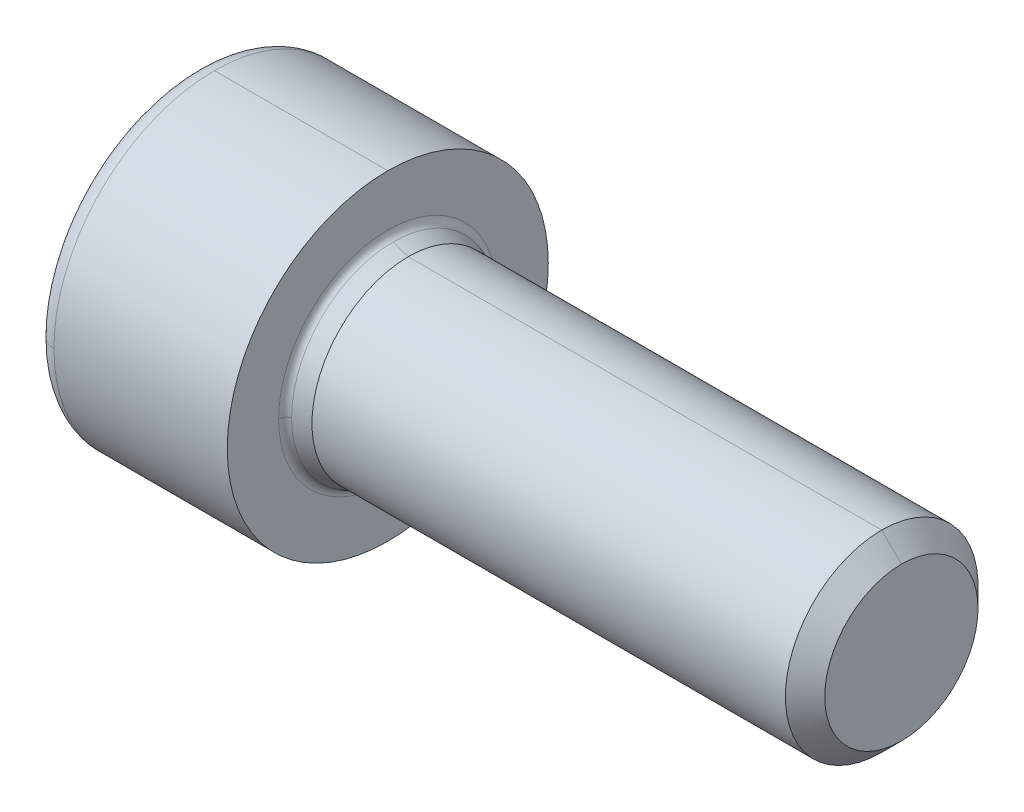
ISO-10303-21;
HEADER;
FILE_DESCRIPTION(('STEP AP214'),'2;1');
FILE_NAME('part.step','',(''),(''),'','','');
FILE_SCHEMA(('AUTOMOTIVE_DESIGN { 1 0 10303 214 1 1 1 1 }'));
ENDSEC;
DATA;
#1=APPLICATION_CONTEXT('core data for automotive mechanical design processes');
#2=APPLICATION_PROTOCOL_DEFINITION('international standard','automotive_design',2000,#1);
#3=PRODUCT_CONTEXT('',#1,'mechanical');
#4=PRODUCT('Part','Part','',(#3));
#5=PRODUCT_RELATED_PRODUCT_CATEGORY('part','',(#4));
#6=PRODUCT_DEFINITION_FORMATION('','',#4);
#7=PRODUCT_DEFINITION_CONTEXT('part definition',#1,'design');
#8=PRODUCT_DEFINITION('design','',#6,#7);
#9=PRODUCT_DEFINITION_SHAPE('','',#8);
#10=(LENGTH_UNIT() NAMED_UNIT(*) SI_UNIT(.MILLI.,.METRE.));
#11=(NAMED_UNIT(*) PLANE_ANGLE_UNIT() SI_UNIT($,.RADIAN.));
#12=(NAMED_UNIT(*) SI_UNIT($,.STERADIAN.) SOLID_ANGLE_UNIT());
#13=UNCERTAINTY_MEASURE_WITH_UNIT(LENGTH_MEASURE(1.E-05),#10,'distance_accuracy_value','');
#14=(GEOMETRIC_REPRESENTATION_CONTEXT(3) GLOBAL_UNCERTAINTY_ASSIGNED_CONTEXT((#13)) GLOBAL_UNIT_ASSIGNED_CONTEXT((#10,
#11,#12)) REPRESENTATION_CONTEXT('',''));
#15=CARTESIAN_POINT('',(0.,0.,0.));
#16=DIRECTION('',(0.,0.,1.));
#17=DIRECTION('',(1.,0.,0.));
#18=AXIS2_PLACEMENT_3D('',#15,#16,#17);
#19=CARTESIAN_POINT('',(-1.626424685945,0.,0.));
#20=DIRECTION('',(-1.,0.,0.));
#21=DIRECTION('',(0.,-1.,0.));
#22=AXIS2_PLACEMENT_3D('',#19,#20,#21);
#23=CONICAL_SURFACE('',#22,1.214285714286,1.0471975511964);
#24=DIRECTION('',(0.500000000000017,-0.866025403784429,0.));
#25=VECTOR('',#24,1.);
#26=CARTESIAN_POINT('',(-2.3,2.380952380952,0.));
#27=LINE('',#26,#25);
#28=CARTESIAN_POINT('',(-2.3,2.380952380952,0.));
#29=VERTEX_POINT('',#28);
#30=CARTESIAN_POINT('',(-0.9253565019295,0.,0.));
#31=VERTEX_POINT('',#30);
#32=EDGE_CURVE('E28',#29,#31,#27,.T.);
#33=ORIENTED_EDGE('',*,*,#32,.F.);
#34=CARTESIAN_POINT('',(-2.3,0.,0.));
#35=DIRECTION('',(1.,0.,0.));
#36=DIRECTION('',(0.,-1.,0.));
#37=AXIS2_PLACEMENT_3D('',#34,#35,#36);
#38=CIRCLE('',#37,2.380952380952);
#39=CARTESIAN_POINT('',(-2.3,-2.380952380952,0.));
#40=VERTEX_POINT('',#39);
#41=EDGE_CURVE('E477',#40,#29,#38,.T.);
#42=ORIENTED_EDGE('',*,*,#41,.F.);
#43=DIRECTION('',(-0.500000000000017,-0.866025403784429,0.));
#44=VECTOR('',#43,1.);
#45=CARTESIAN_POINT('',(-0.9253565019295,0.,0.));
#46=LINE('',#45,#44);
#47=EDGE_CURVE('E11',#31,#40,#46,.T.);
#48=ORIENTED_EDGE('',*,*,#47,.F.);
#49=EDGE_LOOP('',(#33,#42,#48));
#50=FACE_BOUND('',#49,.T.);
#51=ADVANCED_FACE('F16',(#50),#23,.F.);
#52=CARTESIAN_POINT('',(-1.626424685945,0.,0.));
#53=DIRECTION('',(-1.,0.,0.));
#54=DIRECTION('',(0.,-1.,0.));
#55=AXIS2_PLACEMENT_3D('',#52,#53,#54);
#56=CONICAL_SURFACE('',#55,1.214285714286,1.0471975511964);
#57=CARTESIAN_POINT('',(-2.3,0.,0.));
#58=DIRECTION('',(1.,0.,0.));
#59=DIRECTION('',(0.,1.,0.));
#60=AXIS2_PLACEMENT_3D('',#57,#58,#59);
#61=CIRCLE('',#60,2.380952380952);
#62=EDGE_CURVE('E484',#29,#40,#61,.T.);
#63=ORIENTED_EDGE('',*,*,#62,.F.);
#64=ORIENTED_EDGE('',*,*,#32,.T.);
#65=ORIENTED_EDGE('',*,*,#47,.T.);
#66=EDGE_LOOP('',(#63,#64,#65));
#67=FACE_BOUND('',#66,.T.);
#68=ADVANCED_FACE('F471',(#67),#56,.F.);
#69=CARTESIAN_POINT('',(-2.3,0.,0.));
#70=DIRECTION('',(1.,0.,0.));
#71=DIRECTION('',(0.,1.,0.));
#72=AXIS2_PLACEMENT_3D('',#69,#70,#71);
#73=PLANE('',#72);
#74=ORIENTED_EDGE('',*,*,#62,.T.);
#75=ORIENTED_EDGE('',*,*,#41,.T.);
#76=EDGE_LOOP('',(#74,#75));
#77=FACE_BOUND('',#76,.T.);
#78=DIRECTION('',(0.,0.500000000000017,-0.866025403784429));
#79=VECTOR('',#78,1.);
#80=CARTESIAN_POINT('',(-2.3,1.443375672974,2.5));
#81=LINE('',#80,#79);
#82=CARTESIAN_POINT('',(-2.3,1.443375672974,2.5));
#83=VERTEX_POINT('',#82);
#84=CARTESIAN_POINT('',(-2.3,2.886751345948,0.));
#85=VERTEX_POINT('',#84);
#86=EDGE_CURVE('E147',#83,#85,#81,.T.);
#87=ORIENTED_EDGE('',*,*,#86,.T.);
#88=DIRECTION('',(0.,-0.500000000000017,-0.866025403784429));
#89=VECTOR('',#88,1.);
#90=CARTESIAN_POINT('',(-2.3,2.886751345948,0.));
#91=LINE('',#90,#89);
#92=CARTESIAN_POINT('',(-2.3,1.443375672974,-2.5));
#93=VERTEX_POINT('',#92);
#94=EDGE_CURVE('E104',#85,#93,#91,.T.);
#95=ORIENTED_EDGE('',*,*,#94,.T.);
#96=DIRECTION('',(0.,-1.,0.));
#97=VECTOR('',#96,1.);
#98=CARTESIAN_POINT('',(-2.3,1.443375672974,-2.5));
#99=LINE('',#98,#97);
#100=CARTESIAN_POINT('',(-2.3,-1.443375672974,-2.5));
#101=VERTEX_POINT('',#100);
#102=EDGE_CURVE('E378',#93,#101,#99,.T.);
#103=ORIENTED_EDGE('',*,*,#102,.T.);
#104=DIRECTION('',(0.,-0.500000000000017,0.866025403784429));
#105=VECTOR('',#104,1.);
#106=CARTESIAN_POINT('',(-2.3,-1.443375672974,-2.5));
#107=LINE('',#106,#105);
#108=CARTESIAN_POINT('',(-2.3,-2.886751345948,0.));
#109=VERTEX_POINT('',#108);
#110=EDGE_CURVE('E390',#101,#109,#107,.T.);
#111=ORIENTED_EDGE('',*,*,#110,.T.);
#112=DIRECTION('',(0.,0.500000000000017,0.866025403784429));
#113=VECTOR('',#112,1.);
#114=CARTESIAN_POINT('',(-2.3,-2.886751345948,0.));
#115=LINE('',#114,#113);
#116=CARTESIAN_POINT('',(-2.3,-1.443375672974,2.5));
#117=VERTEX_POINT('',#116);
#118=EDGE_CURVE('E445',#109,#117,#115,.T.);
#119=ORIENTED_EDGE('',*,*,#118,.T.);
#120=DIRECTION('',(0.,1.,0.));
#121=VECTOR('',#120,1.);
#122=CARTESIAN_POINT('',(-2.3,-1.443375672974,2.5));
#123=LINE('',#122,#121);
#124=EDGE_CURVE('E304',#117,#83,#123,.T.);
#125=ORIENTED_EDGE('',*,*,#124,.T.);
#126=EDGE_LOOP('',(#87,#95,#103,#111,#119,#125));
#127=FACE_BOUND('',#126,.T.);
#128=ADVANCED_FACE('F276',(#77,#127),#73,.F.);
#129=CARTESIAN_POINT('',(-4.15,0.,2.5));
#130=DIRECTION('',(0.,0.,1.));
#131=DIRECTION('',(1.,0.,0.));
#132=AXIS2_PLACEMENT_3D('',#129,#130,#131);
#133=PLANE('',#132);
#134=CARTESIAN_POINT('',(-6.01416810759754,1.43789133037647,2.5));
#135=DIRECTION('',(0.99999890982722,0.00147659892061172,0.));
#136=VECTOR('',#135,1.);
#137=LINE('',#134,#136);
#138=CARTESIAN_POINT('',(-6.01165739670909,1.43937517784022,2.49307093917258));
#139=VERTEX_POINT('',#138);
#140=EDGE_CURVE('E135',#139,#83,#137,.T.);
#141=ORIENTED_EDGE('',*,*,#140,.T.);
#142=ORIENTED_EDGE('',*,*,#124,.F.);
#143=CARTESIAN_POINT('',(-2.3,-1.443375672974,2.5));
#144=DIRECTION('',(-0.999998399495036,0.0017891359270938,0.));
#145=VECTOR('',#144,1.);
#146=LINE('',#143,#145);
#147=CARTESIAN_POINT('',(-6.00854964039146,-1.43771339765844,2.49162942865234));
#148=VERTEX_POINT('',#147);
#149=EDGE_CURVE('E299',#117,#148,#146,.T.);
#150=ORIENTED_EDGE('',*,*,#149,.T.);
#151=CARTESIAN_POINT('',(-6.01497538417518,1.43748769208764,2.48980171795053));
#152=CARTESIAN_POINT('',(-5.97497860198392,1.35142540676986,2.49327300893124));
#153=CARTESIAN_POINT('',(-5.93663935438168,1.26451773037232,2.49571724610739));
#154=CARTESIAN_POINT('',(-5.88367626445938,1.13499719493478,2.49819799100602));
#155=CARTESIAN_POINT('',(-5.86719191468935,1.093148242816,2.49882464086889));
#156=CARTESIAN_POINT('',(-5.83598603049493,1.01038264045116,2.49977703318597));
#157=CARTESIAN_POINT('',(-5.82122403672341,0.969481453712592,2.50011211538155));
#158=CARTESIAN_POINT('',(-5.79346687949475,0.888501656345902,2.50057057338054));
#159=CARTESIAN_POINT('',(-5.78043102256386,0.848437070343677,2.50070021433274));
#160=CARTESIAN_POINT('',(-5.75612515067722,0.769011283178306,2.5008240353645));
#161=CARTESIAN_POINT('',(-5.74481562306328,0.729662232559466,2.50082194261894));
#162=CARTESIAN_POINT('',(-5.72396098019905,0.651540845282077,2.50074597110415));
#163=CARTESIAN_POINT('',(-5.71437909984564,0.612778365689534,2.500673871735));
#164=CARTESIAN_POINT('',(-5.69697650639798,0.53569644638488,2.5005076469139));
#165=CARTESIAN_POINT('',(-5.68912360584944,0.497384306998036,2.50041400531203));
#166=CARTESIAN_POINT('',(-5.6751733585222,0.421063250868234,2.50023895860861));
#167=CARTESIAN_POINT('',(-5.6690503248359,0.383059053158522,2.50015738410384));
#168=CARTESIAN_POINT('',(-5.65855414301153,0.307208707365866,2.50002675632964));
#169=CARTESIAN_POINT('',(-5.65416358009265,0.269364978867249,2.49997737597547));
#170=CARTESIAN_POINT('',(-5.64711793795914,0.19368581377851,2.49990783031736));
#171=CARTESIAN_POINT('',(-5.64445519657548,0.155851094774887,2.4998875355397));
#172=CARTESIAN_POINT('',(-5.64087538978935,0.0800367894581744,2.49988157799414));
#173=CARTESIAN_POINT('',(-5.63996123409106,0.0420570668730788,2.4998959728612));
#174=CARTESIAN_POINT('',(-5.63978845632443,-0.0355830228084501,2.49984980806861));
#175=CARTESIAN_POINT('',(-5.64060474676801,-0.0752435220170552,2.49978590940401));
#176=CARTESIAN_POINT('',(-5.64401296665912,-0.154106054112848,2.49957378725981));
#177=CARTESIAN_POINT('',(-5.64658773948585,-0.193308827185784,2.4994263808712));
#178=CARTESIAN_POINT('',(-5.65352363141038,-0.271415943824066,2.49912831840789));
#179=CARTESIAN_POINT('',(-5.65787837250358,-0.310320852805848,2.49897767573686));
#180=CARTESIAN_POINT('',(-5.66835679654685,-0.387990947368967,2.49870679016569));
#181=CARTESIAN_POINT('',(-5.67448490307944,-0.426755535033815,2.49858662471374));
#182=CARTESIAN_POINT('',(-5.68850264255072,-0.504299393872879,2.49840239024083));
#183=CARTESIAN_POINT('',(-5.69640660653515,-0.543076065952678,2.49833879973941));
#184=CARTESIAN_POINT('',(-5.7139590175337,-0.620796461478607,2.498265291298));
#185=CARTESIAN_POINT('',(-5.72363011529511,-0.659735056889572,2.4982561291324));
#186=CARTESIAN_POINT('',(-5.74418074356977,-0.735858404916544,2.4983128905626));
#187=CARTESIAN_POINT('',(-5.75500744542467,-0.773057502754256,2.4983762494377));
#188=CARTESIAN_POINT('',(-5.77844915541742,-0.848801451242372,2.49846100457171));
#189=CARTESIAN_POINT('',(-5.79112421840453,-0.887327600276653,2.49848029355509));
#190=CARTESIAN_POINT('',(-5.81825902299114,-0.965865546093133,2.49831907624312));
#191=CARTESIAN_POINT('',(-5.83277580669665,-1.00585752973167,2.49812872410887));
#192=CARTESIAN_POINT('',(-5.86359417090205,-1.08745453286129,2.49738046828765));
#193=CARTESIAN_POINT('',(-5.87994883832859,-1.12903920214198,2.49680451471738));
#194=CARTESIAN_POINT('',(-5.93306399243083,-1.25967471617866,2.49420353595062));
#195=CARTESIAN_POINT('',(-5.97155353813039,-1.34801212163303,2.49127301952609));
#196=CARTESIAN_POINT('',(-6.01131599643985,-1.43565799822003,2.48663259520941));
#197=B_SPLINE_CURVE_WITH_KNOTS('',3,(#151,#152,#153,#154,#155,#156,#157,#158,#159,#160,#161,
#162,#163,#164,#165,#166,#167,#168,#169,#170,#171,#172,#173,#174,#175,#176,#177,#178,#179,#180,
#181,#182,#183,#184,#185,#186,#187,#188,#189,#190,#191,#192,#193,#194,#195,#196),.UNSPECIFIED.,
.F.,.F.,(4,2,2,2,2,2,2,2,2,2,2,2,2,2,2,2,2,2,2,2,2,2,4),(0.,0.28489671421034,0.419830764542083,
0.5502640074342,0.676637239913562,0.799436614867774,0.919194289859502,1.03648727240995,
1.15193406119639,1.26618886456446,1.37993346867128,1.4938671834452,1.61283361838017,
1.73065563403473,1.84805911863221,1.96575802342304,2.08444323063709,2.20477268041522,
2.3209747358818,2.44262633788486,2.57024463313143,2.70429811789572,2.99335390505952),.UNSPECIFIED.);
#198=EDGE_CURVE('E80',#139,#148,#197,.T.);
#199=ORIENTED_EDGE('',*,*,#198,.F.);
#200=EDGE_LOOP('',(#141,#142,#150,#199));
#201=FACE_BOUND('',#200,.T.);
#202=ADVANCED_FACE('F267',(#201),#133,.F.);
#203=CARTESIAN_POINT('',(-5.818898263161,0.,0.));
#204=DIRECTION('',(-1.,0.,0.));
#205=DIRECTION('',(0.,-1.,0.));
#206=AXIS2_PLACEMENT_3D('',#203,#204,#205);
#207=CONICAL_SURFACE('',#206,2.678898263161,0.785398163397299);
#208=CARTESIAN_POINT('',(-6.,1.43789133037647,2.49050083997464));
#209=CARTESIAN_POINT('',(-6.,-0.00524433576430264,3.2514933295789));
#210=CARTESIAN_POINT('',(-6.,-1.43673948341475,2.48850578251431));
#211=B_SPLINE_CURVE_WITH_KNOTS('',2,(#208,#209,#210),.UNSPECIFIED.,.F.,.F.,(3,3),(0.,1.),.UNSPECIFIED.);
#212=EDGE_CURVE('E342',#139,#148,#211,.T.);
#213=ORIENTED_EDGE('',*,*,#212,.F.);
#214=ORIENTED_EDGE('',*,*,#198,.T.);
#215=EDGE_LOOP('',(#213,#214));
#216=FACE_BOUND('',#215,.T.);
#217=ADVANCED_FACE('F166',(#216),#207,.F.);
#218=CARTESIAN_POINT('',(-6.,-0.002085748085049,0.));
#219=DIRECTION('',(1.,0.,0.));
#220=DIRECTION('',(0.,1.,0.));
#221=AXIS2_PLACEMENT_3D('',#218,#219,#220);
#222=PLANE('',#221);
#223=CARTESIAN_POINT('',(-6.,1.43876814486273,-2.49201952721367));
#224=CARTESIAN_POINT('',(-6.,2.80988352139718,-1.6222447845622));
#225=CARTESIAN_POINT('',(-6.,2.87753628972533,0.));
#226=B_SPLINE_CURVE_WITH_KNOTS('',2,(#223,#224,#225),.UNSPECIFIED.,.F.,.F.,(3,3),(0.,1.),.UNSPECIFIED.);
#227=CARTESIAN_POINT('',(-6.0129526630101,1.4399710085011,-2.49410294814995));
#228=VERTEX_POINT('',#227);
#229=CARTESIAN_POINT('',(-6.0129526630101,2.87994201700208,0.));
#230=VERTEX_POINT('',#229);
#231=EDGE_CURVE('E97',#228,#230,#226,.T.);
#232=ORIENTED_EDGE('',*,*,#231,.T.);
#233=CARTESIAN_POINT('',(-6.,2.87753628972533,0.));
#234=CARTESIAN_POINT('',(-6.,2.80965933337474,1.62680484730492));
#235=CARTESIAN_POINT('',(-6.,1.43789133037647,2.49050083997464));
#236=B_SPLINE_CURVE_WITH_KNOTS('',2,(#233,#234,#235),.UNSPECIFIED.,.F.,.F.,(3,3),(0.,1.),.UNSPECIFIED.);
#237=EDGE_CURVE('E114',#230,#139,#236,.T.);
#238=ORIENTED_EDGE('',*,*,#237,.T.);
#239=ORIENTED_EDGE('',*,*,#212,.T.);
#240=CARTESIAN_POINT('',(-6.,-1.43673948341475,2.48850578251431));
#241=CARTESIAN_POINT('',(-6.,-2.10640963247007,2.07097207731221));
#242=CARTESIAN_POINT('',(-6.,-2.4768284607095,1.42999757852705));
#243=CARTESIAN_POINT('',(-6.,-2.8466246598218,0.790100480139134));
#244=CARTESIAN_POINT('',(-6.,-2.87353614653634,0.0016754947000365));
#245=B_SPLINE_CURVE_WITH_KNOTS('',2,(#240,#241,#242,#243,#244),.UNSPECIFIED.,.F.,.F.,(3,2,3),
(0.,0.5,1.),.UNSPECIFIED.);
#246=CARTESIAN_POINT('',(-6.00902250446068,-2.87689843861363,0.00150759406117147));
#247=VERTEX_POINT('',#246);
#248=EDGE_CURVE('E339',#148,#247,#245,.T.);
#249=ORIENTED_EDGE('',*,*,#248,.T.);
#250=CARTESIAN_POINT('',(-6.,-2.87353614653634,0.0016754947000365));
#251=CARTESIAN_POINT('',(-6.,-2.81852743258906,-1.61962534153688));
#252=CARTESIAN_POINT('',(-6.,-1.43820836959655,-2.49104996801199));
#253=B_SPLINE_CURVE_WITH_KNOTS('',2,(#250,#251,#252),.UNSPECIFIED.,.F.,.F.,(3,3),(0.,1.),.UNSPECIFIED.);
#254=CARTESIAN_POINT('',(-6.0126685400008,-1.43968108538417,-2.49360078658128));
#255=VERTEX_POINT('',#254);
#256=EDGE_CURVE('E341',#247,#255,#253,.T.);
#257=ORIENTED_EDGE('',*,*,#256,.T.);
#258=CARTESIAN_POINT('',(-6.,-1.43820836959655,-2.49104996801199));
#259=CARTESIAN_POINT('',(-6.,-0.00251474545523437,-3.24588737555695));
#260=CARTESIAN_POINT('',(-6.,1.43876814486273,-2.49201952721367));
#261=B_SPLINE_CURVE_WITH_KNOTS('',2,(#258,#259,#260),.UNSPECIFIED.,.F.,.F.,(3,3),(0.,1.),.UNSPECIFIED.);
#262=EDGE_CURVE('E117',#255,#228,#261,.T.);
#263=ORIENTED_EDGE('',*,*,#262,.T.);
#264=EDGE_LOOP('',(#232,#238,#239,#249,#257,#263));
#265=FACE_BOUND('',#264,.T.);
#266=CARTESIAN_POINT('',(-6.,0.,0.));
#267=DIRECTION('',(-1.,0.,0.));
#268=DIRECTION('',(0.,0.,-1.));
#269=AXIS2_PLACEMENT_3D('',#266,#267,#268);
#270=CIRCLE('',#269,4.4);
#271=CARTESIAN_POINT('',(-6.,0.,-4.4));
#272=VERTEX_POINT('',#271);
#273=CARTESIAN_POINT('',(-6.,0.,4.4));
#274=VERTEX_POINT('',#273);
#275=EDGE_CURVE('E534',#272,#274,#270,.T.);
#276=ORIENTED_EDGE('',*,*,#275,.T.);
#277=CARTESIAN_POINT('',(-6.,0.,0.));
#278=DIRECTION('',(-1.,0.,0.));
#279=DIRECTION('',(0.,0.,1.));
#280=AXIS2_PLACEMENT_3D('',#277,#278,#279);
#281=CIRCLE('',#280,4.4);
#282=EDGE_CURVE('E495',#274,#272,#281,.T.);
#283=ORIENTED_EDGE('',*,*,#282,.T.);
#284=EDGE_LOOP('',(#276,#283));
#285=FACE_BOUND('',#284,.T.);
#286=ADVANCED_FACE('F110',(#265,#285),#222,.F.);
#287=CARTESIAN_POINT('',(-5.4,0.,0.));
#288=DIRECTION('',(-1.,0.,0.));
#289=DIRECTION('',(0.,0.,1.));
#290=AXIS2_PLACEMENT_3D('',#287,#288,#289);
#291=TOROIDAL_SURFACE('',#290,4.4,0.6);
#292=CARTESIAN_POINT('',(-5.4,0.,0.));
#293=DIRECTION('',(-1.,0.,0.));
#294=DIRECTION('',(0.,0.,1.));
#295=AXIS2_PLACEMENT_3D('',#292,#293,#294);
#296=CIRCLE('',#295,5.);
#297=CARTESIAN_POINT('',(-5.4,0.,5.));
#298=VERTEX_POINT('',#297);
#299=CARTESIAN_POINT('',(-5.4,5.,0.));
#300=VERTEX_POINT('',#299);
#301=EDGE_CURVE('E540',#298,#300,#296,.T.);
#302=ORIENTED_EDGE('',*,*,#301,.T.);
#303=CARTESIAN_POINT('',(-5.4,0.,0.));
#304=DIRECTION('',(-1.,0.,0.));
#305=DIRECTION('',(0.,1.,0.));
#306=AXIS2_PLACEMENT_3D('',#303,#304,#305);
#307=CIRCLE('',#306,5.);
#308=CARTESIAN_POINT('',(-5.4,0.,-5.));
#309=VERTEX_POINT('',#308);
#310=EDGE_CURVE('E548',#300,#309,#307,.T.);
#311=ORIENTED_EDGE('',*,*,#310,.T.);
#312=CARTESIAN_POINT('',(-5.4,0.,-4.4));
#313=DIRECTION('',(0.,-1.,0.));
#314=DIRECTION('',(-1.,0.,0.));
#315=AXIS2_PLACEMENT_3D('',#312,#313,#314);
#316=CIRCLE('',#315,0.6);
#317=EDGE_CURVE('E525',#272,#309,#316,.T.);
#318=ORIENTED_EDGE('',*,*,#317,.F.);
#319=ORIENTED_EDGE('',*,*,#282,.F.);
#320=CARTESIAN_POINT('',(-5.4,0.,4.4));
#321=DIRECTION('',(0.,-1.,0.));
#322=DIRECTION('',(0.,0.,1.));
#323=AXIS2_PLACEMENT_3D('',#320,#321,#322);
#324=CIRCLE('',#323,0.6);
#325=EDGE_CURVE('E516',#298,#274,#324,.T.);
#326=ORIENTED_EDGE('',*,*,#325,.F.);
#327=EDGE_LOOP('',(#302,#311,#318,#319,#326));
#328=FACE_BOUND('',#327,.T.);
#329=ADVANCED_FACE('F165',(#328),#291,.T.);
#330=CARTESIAN_POINT('',(-5.4,0.,0.));
#331=DIRECTION('',(-1.,0.,0.));
#332=DIRECTION('',(0.,0.,1.));
#333=AXIS2_PLACEMENT_3D('',#330,#331,#332);
#334=TOROIDAL_SURFACE('',#333,4.4,0.6);
#335=ORIENTED_EDGE('',*,*,#275,.F.);
#336=ORIENTED_EDGE('',*,*,#317,.T.);
#337=CARTESIAN_POINT('',(-5.4,0.,0.));
#338=DIRECTION('',(-1.,0.,0.));
#339=DIRECTION('',(0.,0.,-1.));
#340=AXIS2_PLACEMENT_3D('',#337,#338,#339);
#341=CIRCLE('',#340,5.);
#342=CARTESIAN_POINT('',(-5.4,-5.,0.));
#343=VERTEX_POINT('',#342);
#344=EDGE_CURVE('E552',#309,#343,#341,.T.);
#345=ORIENTED_EDGE('',*,*,#344,.T.);
#346=CARTESIAN_POINT('',(-5.4,0.,0.));
#347=DIRECTION('',(-1.,0.,0.));
#348=DIRECTION('',(0.,-1.,0.));
#349=AXIS2_PLACEMENT_3D('',#346,#347,#348);
#350=CIRCLE('',#349,5.);
#351=EDGE_CURVE('E539',#343,#298,#350,.T.);
#352=ORIENTED_EDGE('',*,*,#351,.T.);
#353=ORIENTED_EDGE('',*,*,#325,.T.);
#354=EDGE_LOOP('',(#335,#336,#345,#352,#353));
#355=FACE_BOUND('',#354,.T.);
#356=ADVANCED_FACE('F772',(#355),#334,.T.);
#357=CARTESIAN_POINT('',(-5.400000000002,0.,0.));
#358=DIRECTION('',(-1.,0.,0.));
#359=DIRECTION('',(0.,1.,0.));
#360=AXIS2_PLACEMENT_3D('',#357,#358,#359);
#361=CYLINDRICAL_SURFACE('',#360,5.);
#362=ORIENTED_EDGE('',*,*,#301,.F.);
#363=ORIENTED_EDGE('',*,*,#351,.F.);
#364=DIRECTION('',(1.,0.,0.));
#365=VECTOR('',#364,1.);
#366=CARTESIAN_POINT('',(-5.4,-5.,0.));
#367=LINE('',#366,#365);
#368=CARTESIAN_POINT('',(0.,-5.,0.));
#369=VERTEX_POINT('',#368);
#370=EDGE_CURVE('E555',#343,#369,#367,.T.);
#371=ORIENTED_EDGE('',*,*,#370,.T.);
#372=CARTESIAN_POINT('',(0.,0.,0.));
#373=DIRECTION('',(1.,0.,0.));
#374=DIRECTION('',(0.,1.,0.));
#375=AXIS2_PLACEMENT_3D('',#372,#373,#374);
#376=CIRCLE('',#375,5.);
#377=CARTESIAN_POINT('',(0.,5.,0.));
#378=VERTEX_POINT('',#377);
#379=EDGE_CURVE('E562',#378,#369,#376,.T.);
#380=ORIENTED_EDGE('',*,*,#379,.F.);
#381=DIRECTION('',(-1.,0.,0.));
#382=VECTOR('',#381,1.);
#383=CARTESIAN_POINT('',(0.,5.,0.));
#384=LINE('',#383,#382);
#385=EDGE_CURVE('E544',#378,#300,#384,.T.);
#386=ORIENTED_EDGE('',*,*,#385,.T.);
#387=EDGE_LOOP('',(#362,#363,#371,#380,#386));
#388=FACE_BOUND('',#387,.T.);
#389=ADVANCED_FACE('F240',(#388),#361,.T.);
#390=CARTESIAN_POINT('',(-5.400000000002,0.,0.));
#391=DIRECTION('',(-1.,0.,0.));
#392=DIRECTION('',(0.,1.,0.));
#393=AXIS2_PLACEMENT_3D('',#390,#391,#392);
#394=CYLINDRICAL_SURFACE('',#393,5.);
#395=CARTESIAN_POINT('',(0.,0.,0.));
#396=DIRECTION('',(1.,0.,0.));
#397=DIRECTION('',(0.,-1.,0.));
#398=AXIS2_PLACEMENT_3D('',#395,#396,#397);
#399=CIRCLE('',#398,5.);
#400=EDGE_CURVE('E558',#369,#378,#399,.T.);
#401=ORIENTED_EDGE('',*,*,#400,.F.);
#402=ORIENTED_EDGE('',*,*,#370,.F.);
#403=ORIENTED_EDGE('',*,*,#344,.F.);
#404=ORIENTED_EDGE('',*,*,#310,.F.);
#405=ORIENTED_EDGE('',*,*,#385,.F.);
#406=EDGE_LOOP('',(#401,#402,#403,#404,#405));
#407=FACE_BOUND('',#406,.T.);
#408=ADVANCED_FACE('F784',(#407),#394,.T.);
#409=CARTESIAN_POINT('',(0.,0.,0.));
#410=DIRECTION('',(-1.,0.,0.));
#411=DIRECTION('',(0.,0.,1.));
#412=AXIS2_PLACEMENT_3D('',#409,#410,#411);
#413=PLANE('',#412);
#414=CARTESIAN_POINT('',(0.,0.,0.));
#415=DIRECTION('',(-1.,0.,0.));
#416=DIRECTION('',(0.,0.,-1.));
#417=AXIS2_PLACEMENT_3D('',#414,#415,#416);
#418=CIRCLE('',#417,3.4);
#419=CARTESIAN_POINT('',(0.,0.,-3.4));
#420=VERTEX_POINT('',#419);
#421=CARTESIAN_POINT('',(0.,0.,3.4));
#422=VERTEX_POINT('',#421);
#423=EDGE_CURVE('E574',#420,#422,#418,.T.);
#424=ORIENTED_EDGE('',*,*,#423,.T.);
#425=CARTESIAN_POINT('',(0.,0.,0.));
#426=DIRECTION('',(-1.,0.,0.));
#427=DIRECTION('',(0.,0.,1.));
#428=AXIS2_PLACEMENT_3D('',#425,#426,#427);
#429=CIRCLE('',#428,3.4);
#430=EDGE_CURVE('E566',#422,#420,#429,.T.);
#431=ORIENTED_EDGE('',*,*,#430,.T.);
#432=EDGE_LOOP('',(#424,#431));
#433=FACE_BOUND('',#432,.T.);
#434=ORIENTED_EDGE('',*,*,#379,.T.);
#435=ORIENTED_EDGE('',*,*,#400,.T.);
#436=EDGE_LOOP('',(#434,#435));
#437=FACE_BOUND('',#436,.T.);
#438=ADVANCED_FACE('F782',(#433,#437),#413,.F.);
#439=CARTESIAN_POINT('',(0.25,0.,0.));
#440=DIRECTION('',(-1.,0.,0.));
#441=DIRECTION('',(0.,0.,1.));
#442=AXIS2_PLACEMENT_3D('',#439,#440,#441);
#443=TOROIDAL_SURFACE('',#442,3.4,0.25);
#444=CARTESIAN_POINT('',(0.25,0.,-3.4));
#445=DIRECTION('',(0.,-1.,0.));
#446=DIRECTION('',(-0.329372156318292,0.,0.944200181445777));
#447=AXIS2_PLACEMENT_3D('',#444,#445,#446);
#448=CIRCLE('',#447,0.25);
#449=CARTESIAN_POINT('',(0.1676569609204,0.,-3.163949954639));
#450=VERTEX_POINT('',#449);
#451=EDGE_CURVE('E570',#450,#420,#448,.T.);
#452=ORIENTED_EDGE('',*,*,#451,.T.);
#453=ORIENTED_EDGE('',*,*,#430,.F.);
#454=CARTESIAN_POINT('',(0.25,0.,3.4));
#455=DIRECTION('',(0.,-1.,0.));
#456=DIRECTION('',(-1.,0.,0.));
#457=AXIS2_PLACEMENT_3D('',#454,#455,#456);
#458=CIRCLE('',#457,0.25);
#459=CARTESIAN_POINT('',(0.1676569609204,0.,3.163949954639));
#460=VERTEX_POINT('',#459);
#461=EDGE_CURVE('E578',#422,#460,#458,.T.);
#462=ORIENTED_EDGE('',*,*,#461,.T.);
#463=CARTESIAN_POINT('',(0.1676569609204,0.,0.));
#464=DIRECTION('',(-1.,0.,0.));
#465=DIRECTION('',(0.,0.,1.));
#466=AXIS2_PLACEMENT_3D('',#463,#464,#465);
#467=CIRCLE('',#466,3.163949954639);
#468=CARTESIAN_POINT('',(0.1676569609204,3.163949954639,0.));
#469=VERTEX_POINT('',#468);
#470=EDGE_CURVE('E586',#460,#469,#467,.T.);
#471=ORIENTED_EDGE('',*,*,#470,.T.);
#472=CARTESIAN_POINT('',(0.1676569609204,0.,0.));
#473=DIRECTION('',(-1.,0.,0.));
#474=DIRECTION('',(0.,1.,0.));
#475=AXIS2_PLACEMENT_3D('',#472,#473,#474);
#476=CIRCLE('',#475,3.163949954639);
#477=EDGE_CURVE('E591',#469,#450,#476,.T.);
#478=ORIENTED_EDGE('',*,*,#477,.T.);
#479=EDGE_LOOP('',(#452,#453,#462,#471,#478));
#480=FACE_BOUND('',#479,.T.);
#481=ADVANCED_FACE('F668',(#480),#443,.F.);
#482=CARTESIAN_POINT('',(0.25,0.,0.));
#483=DIRECTION('',(-1.,0.,0.));
#484=DIRECTION('',(0.,0.,1.));
#485=AXIS2_PLACEMENT_3D('',#482,#483,#484);
#486=TOROIDAL_SURFACE('',#485,3.4,0.25);
#487=CARTESIAN_POINT('',(0.1676569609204,0.,0.));
#488=DIRECTION('',(-1.,0.,0.));
#489=DIRECTION('',(0.,0.,-1.));
#490=AXIS2_PLACEMENT_3D('',#487,#488,#489);
#491=CIRCLE('',#490,3.163949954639);
#492=CARTESIAN_POINT('',(0.1676569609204,-3.163949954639,0.));
#493=VERTEX_POINT('',#492);
#494=EDGE_CURVE('E595',#450,#493,#491,.T.);
#495=ORIENTED_EDGE('',*,*,#494,.T.);
#496=CARTESIAN_POINT('',(0.1676569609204,0.,0.));
#497=DIRECTION('',(-1.,0.,0.));
#498=DIRECTION('',(0.,-1.,0.));
#499=AXIS2_PLACEMENT_3D('',#496,#497,#498);
#500=CIRCLE('',#499,3.163949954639);
#501=EDGE_CURVE('E582',#493,#460,#500,.T.);
#502=ORIENTED_EDGE('',*,*,#501,.T.);
#503=ORIENTED_EDGE('',*,*,#461,.F.);
#504=ORIENTED_EDGE('',*,*,#423,.F.);
#505=ORIENTED_EDGE('',*,*,#451,.F.);
#506=EDGE_LOOP('',(#495,#502,#503,#504,#505));
#507=FACE_BOUND('',#506,.T.);
#508=ADVANCED_FACE('F777',(#507),#486,.F.);
#509=CARTESIAN_POINT('',(0.4026518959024,0.,0.));
#510=DIRECTION('',(-1.,0.,0.));
#511=DIRECTION('',(0.,-1.,0.));
#512=AXIS2_PLACEMENT_3D('',#509,#510,#511);
#513=CONICAL_SURFACE('',#512,3.081974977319,0.335638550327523);
#514=ORIENTED_EDGE('',*,*,#470,.F.);
#515=ORIENTED_EDGE('',*,*,#501,.F.);
#516=DIRECTION('',(0.944200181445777,0.329372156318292,0.));
#517=VECTOR('',#516,1.);
#518=CARTESIAN_POINT('',(0.1676569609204,-3.163949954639,0.));
#519=LINE('',#518,#517);
#520=CARTESIAN_POINT('',(0.6376468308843,-3.,0.));
#521=VERTEX_POINT('',#520);
#522=EDGE_CURVE('E599',#493,#521,#519,.T.);
#523=ORIENTED_EDGE('',*,*,#522,.T.);
#524=CARTESIAN_POINT('',(0.6376468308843,0.,0.));
#525=DIRECTION('',(1.,0.,0.));
#526=DIRECTION('',(0.,0.,1.));
#527=AXIS2_PLACEMENT_3D('',#524,#525,#526);
#528=CIRCLE('',#527,3.);
#529=CARTESIAN_POINT('',(0.6376468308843,3.,0.));
#530=VERTEX_POINT('',#529);
#531=EDGE_CURVE('E610',#530,#521,#528,.T.);
#532=ORIENTED_EDGE('',*,*,#531,.F.);
#533=DIRECTION('',(-0.944200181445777,0.329372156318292,0.));
#534=VECTOR('',#533,1.);
#535=CARTESIAN_POINT('',(0.6376468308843,3.,0.));
#536=LINE('',#535,#534);
#537=EDGE_CURVE('E590',#530,#469,#536,.T.);
#538=ORIENTED_EDGE('',*,*,#537,.T.);
#539=EDGE_LOOP('',(#514,#515,#523,#532,#538));
#540=FACE_BOUND('',#539,.T.);
#541=ADVANCED_FACE('F656',(#540),#513,.T.);
#542=CARTESIAN_POINT('',(0.4026518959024,0.,0.));
#543=DIRECTION('',(-1.,0.,0.));
#544=DIRECTION('',(0.,-1.,0.));
#545=AXIS2_PLACEMENT_3D('',#542,#543,#544);
#546=CONICAL_SURFACE('',#545,3.081974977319,0.335638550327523);
#547=CARTESIAN_POINT('',(0.6376468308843,0.,0.));
#548=DIRECTION('',(-1.,0.,0.));
#549=DIRECTION('',(0.,1.,0.));
#550=AXIS2_PLACEMENT_3D('',#547,#548,#549);
#551=CIRCLE('',#550,3.);
#552=EDGE_CURVE('E603',#530,#521,#551,.T.);
#553=ORIENTED_EDGE('',*,*,#552,.T.);
#554=ORIENTED_EDGE('',*,*,#522,.F.);
#555=ORIENTED_EDGE('',*,*,#494,.F.);
#556=ORIENTED_EDGE('',*,*,#477,.F.);
#557=ORIENTED_EDGE('',*,*,#537,.F.);
#558=EDGE_LOOP('',(#553,#554,#555,#556,#557));
#559=FACE_BOUND('',#558,.T.);
#560=ADVANCED_FACE('F317',(#559),#546,.T.);
#561=CARTESIAN_POINT('',(0.6799999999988,0.,0.));
#562=DIRECTION('',(-1.,0.,0.));
#563=DIRECTION('',(0.,1.,0.));
#564=AXIS2_PLACEMENT_3D('',#561,#562,#563);
#565=CYLINDRICAL_SURFACE('',#564,3.);
#566=CARTESIAN_POINT('',(15.3865,0.,0.));
#567=DIRECTION('',(1.,0.,0.));
#568=DIRECTION('',(0.,-1.,0.));
#569=AXIS2_PLACEMENT_3D('',#566,#567,#568);
#570=CIRCLE('',#569,3.);
#571=CARTESIAN_POINT('',(15.3865,-3.,0.));
#572=VERTEX_POINT('',#571);
#573=CARTESIAN_POINT('',(15.3865,3.,0.));
#574=VERTEX_POINT('',#573);
#575=EDGE_CURVE('E627',#572,#574,#570,.T.);
#576=ORIENTED_EDGE('',*,*,#575,.F.);
#577=DIRECTION('',(1.,0.,0.));
#578=VECTOR('',#577,1.);
#579=CARTESIAN_POINT('',(0.6376468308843,-3.,0.));
#580=LINE('',#579,#578);
#581=EDGE_CURVE('E607',#521,#572,#580,.T.);
#582=ORIENTED_EDGE('',*,*,#581,.F.);
#583=ORIENTED_EDGE('',*,*,#552,.F.);
#584=DIRECTION('',(-1.,0.,0.));
#585=VECTOR('',#584,1.);
#586=CARTESIAN_POINT('',(15.3865,3.,0.));
#587=LINE('',#586,#585);
#588=EDGE_CURVE('E615',#574,#530,#587,.T.);
#589=ORIENTED_EDGE('',*,*,#588,.F.);
#590=EDGE_LOOP('',(#576,#582,#583,#589));
#591=FACE_BOUND('',#590,.T.);
#592=ADVANCED_FACE('F763',(#591),#565,.T.);
#593=CARTESIAN_POINT('',(0.6799999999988,0.,0.));
#594=DIRECTION('',(-1.,0.,0.));
#595=DIRECTION('',(0.,1.,0.));
#596=AXIS2_PLACEMENT_3D('',#593,#594,#595);
#597=CYLINDRICAL_SURFACE('',#596,3.);
#598=ORIENTED_EDGE('',*,*,#588,.T.);
#599=ORIENTED_EDGE('',*,*,#531,.T.);
#600=ORIENTED_EDGE('',*,*,#581,.T.);
#601=CARTESIAN_POINT('',(15.3865,0.,0.));
#602=DIRECTION('',(1.,0.,0.));
#603=DIRECTION('',(0.,1.,0.));
#604=AXIS2_PLACEMENT_3D('',#601,#602,#603);
#605=CIRCLE('',#604,3.);
#606=EDGE_CURVE('E619',#574,#572,#605,.T.);
#607=ORIENTED_EDGE('',*,*,#606,.F.);
#608=EDGE_LOOP('',(#598,#599,#600,#607));
#609=FACE_BOUND('',#608,.T.);
#610=ADVANCED_FACE('F764',(#609),#597,.T.);
#611=CARTESIAN_POINT('',(15.69325,0.,0.));
#612=DIRECTION('',(-1.,0.,0.));
#613=DIRECTION('',(0.,-1.,0.));
#614=AXIS2_PLACEMENT_3D('',#611,#612,#613);
#615=CONICAL_SURFACE('',#614,2.69325,0.785398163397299);
#616=ORIENTED_EDGE('',*,*,#606,.T.);
#617=DIRECTION('',(0.707106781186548,0.707106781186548,0.));
#618=VECTOR('',#617,1.);
#619=CARTESIAN_POINT('',(15.3865,-3.,0.));
#620=LINE('',#619,#618);
#621=CARTESIAN_POINT('',(16.,-2.3865,0.));
#622=VERTEX_POINT('',#621);
#623=EDGE_CURVE('E631',#572,#622,#620,.T.);
#624=ORIENTED_EDGE('',*,*,#623,.T.);
#625=CARTESIAN_POINT('',(16.,0.,0.));
#626=DIRECTION('',(1.,0.,0.));
#627=DIRECTION('',(0.,1.,0.));
#628=AXIS2_PLACEMENT_3D('',#625,#626,#627);
#629=CIRCLE('',#628,2.3865);
#630=CARTESIAN_POINT('',(16.,2.3865,0.));
#631=VERTEX_POINT('',#630);
#632=EDGE_CURVE('E639',#631,#622,#629,.T.);
#633=ORIENTED_EDGE('',*,*,#632,.F.);
#634=DIRECTION('',(-0.707106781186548,0.707106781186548,0.));
#635=VECTOR('',#634,1.);
#636=CARTESIAN_POINT('',(16.,2.3865,0.));
#637=LINE('',#636,#635);
#638=EDGE_CURVE('E623',#631,#574,#637,.T.);
#639=ORIENTED_EDGE('',*,*,#638,.T.);
#640=EDGE_LOOP('',(#616,#624,#633,#639));
#641=FACE_BOUND('',#640,.T.);
#642=ADVANCED_FACE('F760',(#641),#615,.T.);
#643=CARTESIAN_POINT('',(15.69325,0.,0.));
#644=DIRECTION('',(-1.,0.,0.));
#645=DIRECTION('',(0.,-1.,0.));
#646=AXIS2_PLACEMENT_3D('',#643,#644,#645);
#647=CONICAL_SURFACE('',#646,2.69325,0.785398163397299);
#648=CARTESIAN_POINT('',(16.,0.,0.));
#649=DIRECTION('',(1.,0.,0.));
#650=DIRECTION('',(0.,-1.,0.));
#651=AXIS2_PLACEMENT_3D('',#648,#649,#650);
#652=CIRCLE('',#651,2.3865);
#653=EDGE_CURVE('E635',#622,#631,#652,.T.);
#654=ORIENTED_EDGE('',*,*,#653,.F.);
#655=ORIENTED_EDGE('',*,*,#623,.F.);
#656=ORIENTED_EDGE('',*,*,#575,.T.);
#657=ORIENTED_EDGE('',*,*,#638,.F.);
#658=EDGE_LOOP('',(#654,#655,#656,#657));
#659=FACE_BOUND('',#658,.T.);
#660=ADVANCED_FACE('F241',(#659),#647,.T.);
#661=CARTESIAN_POINT('',(16.,0.,0.));
#662=DIRECTION('',(-1.,0.,0.));
#663=DIRECTION('',(0.,0.,1.));
#664=AXIS2_PLACEMENT_3D('',#661,#662,#663);
#665=PLANE('',#664);
#666=ORIENTED_EDGE('',*,*,#632,.T.);
#667=ORIENTED_EDGE('',*,*,#653,.T.);
#668=EDGE_LOOP('',(#666,#667));
#669=FACE_BOUND('',#668,.T.);
#670=ADVANCED_FACE('F759',(#669),#665,.F.);
#671=CARTESIAN_POINT('',(-5.818898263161,0.,0.));
#672=DIRECTION('',(-1.,0.,0.));
#673=DIRECTION('',(0.,-1.,0.));
#674=AXIS2_PLACEMENT_3D('',#671,#672,#673);
#675=CONICAL_SURFACE('',#674,2.678898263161,0.785398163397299);
#676=ORIENTED_EDGE('',*,*,#262,.F.);
#677=CARTESIAN_POINT('',(-6.01602936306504,-1.43801468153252,-2.49071449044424));
#678=CARTESIAN_POINT('',(-5.98556816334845,-1.37294465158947,-2.49309065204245));
#679=CARTESIAN_POINT('',(-5.95607960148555,-1.30737446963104,-2.49492155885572));
#680=CARTESIAN_POINT('',(-5.90116723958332,-1.17858653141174,-2.49764168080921));
#681=CARTESIAN_POINT('',(-5.87561136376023,-1.11542578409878,-2.49857525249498));
#682=CARTESIAN_POINT('',(-5.82854501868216,-0.991116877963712,-2.49982042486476));
#683=CARTESIAN_POINT('',(-5.80689789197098,-0.930021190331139,-2.50016018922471));
#684=CARTESIAN_POINT('',(-5.76766015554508,-0.809452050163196,-2.50049819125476));
#685=CARTESIAN_POINT('',(-5.7499342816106,-0.750023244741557,-2.50051060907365));
#686=CARTESIAN_POINT('',(-5.72618062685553,-0.661027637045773,-2.50043186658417));
#687=CARTESIAN_POINT('',(-5.71882314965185,-0.631812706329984,-2.50039066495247));
#688=CARTESIAN_POINT('',(-5.70510206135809,-0.573633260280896,-2.50029596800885));
#689=CARTESIAN_POINT('',(-5.69872465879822,-0.544672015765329,-2.50024267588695));
#690=CARTESIAN_POINT('',(-5.68696234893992,-0.486941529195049,-2.50013865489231));
#691=CARTESIAN_POINT('',(-5.68156558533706,-0.458174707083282,-2.50008790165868));
#692=CARTESIAN_POINT('',(-5.67176239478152,-0.400771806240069,-2.49999887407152));
#693=CARTESIAN_POINT('',(-5.66734650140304,-0.372137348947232,-2.49996047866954));
#694=CARTESIAN_POINT('',(-5.65950251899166,-0.314936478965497,-2.49990098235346));
#695=CARTESIAN_POINT('',(-5.65606775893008,-0.286370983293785,-2.49987976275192));
#696=CARTESIAN_POINT('',(-5.65018315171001,-0.229243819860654,-2.49985419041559));
#697=CARTESIAN_POINT('',(-5.64772975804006,-0.200682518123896,-2.49984977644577));
#698=CARTESIAN_POINT('',(-5.64380450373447,-0.143498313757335,-2.49985173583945));
#699=CARTESIAN_POINT('',(-5.64233244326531,-0.114875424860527,-2.49985810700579));
#700=CARTESIAN_POINT('',(-5.64036701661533,-0.0575017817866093,-2.49987068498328));
#701=CARTESIAN_POINT('',(-5.63987689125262,-0.028750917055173,-2.4998768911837));
#702=CARTESIAN_POINT('',(-5.63986975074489,0.0288301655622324,-2.49986975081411));
#703=CARTESIAN_POINT('',(-5.64035542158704,0.0576603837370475,-2.49985635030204));
#704=CARTESIAN_POINT('',(-5.64231375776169,0.115181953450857,-2.49982608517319));
#705=CARTESIAN_POINT('',(-5.64378281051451,0.143873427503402,-2.49980923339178));
#706=CARTESIAN_POINT('',(-5.64770502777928,0.201184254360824,-2.49978530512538));
#707=CARTESIAN_POINT('',(-5.65015803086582,0.229803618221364,-2.49977822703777));
#708=CARTESIAN_POINT('',(-5.65604450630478,0.287036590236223,-2.499780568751));
#709=CARTESIAN_POINT('',(-5.65948118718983,0.315649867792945,-2.49979004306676));
#710=CARTESIAN_POINT('',(-5.66733171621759,0.372936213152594,-2.49982691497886));
#711=CARTESIAN_POINT('',(-5.67175192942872,0.401608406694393,-2.4998544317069));
#712=CARTESIAN_POINT('',(-5.68156640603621,0.459076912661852,-2.49992354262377));
#713=CARTESIAN_POINT('',(-5.68696986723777,0.487871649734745,-2.49996527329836));
#714=CARTESIAN_POINT('',(-5.698748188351,0.545648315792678,-2.5000540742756));
#715=CARTESIAN_POINT('',(-5.70513467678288,0.574627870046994,-2.50010120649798));
#716=CARTESIAN_POINT('',(-5.7188764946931,0.63283448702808,-2.50018736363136));
#717=CARTESIAN_POINT('',(-5.72624542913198,0.662058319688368,-2.50022625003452));
#718=CARTESIAN_POINT('',(-5.75003464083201,0.751055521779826,-2.50030520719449));
#719=CARTESIAN_POINT('',(-5.76779040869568,0.810474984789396,-2.50030309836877));
#720=CARTESIAN_POINT('',(-5.8070982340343,0.930989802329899,-2.50001213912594));
#721=CARTESIAN_POINT('',(-5.8287849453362,0.992040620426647,-2.49971041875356));
#722=CARTESIAN_POINT('',(-5.87594026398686,1.11622574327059,-2.49857581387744));
#723=CARTESIAN_POINT('',(-5.90154533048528,1.17930754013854,-2.49771662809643));
#724=CARTESIAN_POINT('',(-5.95656539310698,1.30790544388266,-2.4951881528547));
#725=CARTESIAN_POINT('',(-5.98611251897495,1.37336443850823,-2.49347687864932));
#726=CARTESIAN_POINT('',(-6.0166393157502,1.43831965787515,-2.49124272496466));
#727=B_SPLINE_CURVE_WITH_KNOTS('',3,(#677,#678,#679,#680,#681,#682,#683,#684,#685,#686,#687,
#688,#689,#690,#691,#692,#693,#694,#695,#696,#697,#698,#699,#700,#701,#702,#703,#704,#705,#706,
#707,#708,#709,#710,#711,#712,#713,#714,#715,#716,#717,#718,#719,#720,#721,#722,#723,#724,#725,
#726),.UNSPECIFIED.,.F.,.F.,(4,2,2,2,2,2,2,2,2,2,2,2,2,2,2,2,2,2,2,2,2,2,2,2,4),(0.,
0.215682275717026,0.420051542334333,0.614434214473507,0.80038201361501,0.890752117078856,
0.979703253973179,1.06749461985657,1.15439784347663,1.24069529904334,1.32667800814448,
1.41264320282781,1.49889165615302,1.58537784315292,1.67154804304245,1.75770411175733,
1.8441444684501,1.93116140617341,2.0190386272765,2.10804911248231,2.19845339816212,
2.38439899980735,2.57869324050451,2.78289519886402,2.99833627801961),.UNSPECIFIED.);
#728=EDGE_CURVE('E375',#255,#228,#727,.T.);
#729=ORIENTED_EDGE('',*,*,#728,.T.);
#730=EDGE_LOOP('',(#676,#729));
#731=FACE_BOUND('',#730,.T.);
#732=ADVANCED_FACE('F216',(#731),#675,.F.);
#733=CARTESIAN_POINT('',(-4.15,0.,-2.5));
#734=DIRECTION('',(0.,0.,-1.));
#735=DIRECTION('',(0.,-1.,0.));
#736=AXIS2_PLACEMENT_3D('',#733,#734,#735);
#737=PLANE('',#736);
#738=ORIENTED_EDGE('',*,*,#102,.F.);
#739=CARTESIAN_POINT('',(-6.01574234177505,1.44567943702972,-2.49600976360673));
#740=DIRECTION('',(0.999999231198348,-0.000620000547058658,-0.00107387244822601));
#741=VECTOR('',#740,1.);
#742=LINE('',#739,#741);
#743=EDGE_CURVE('E347',#228,#93,#742,.T.);
#744=ORIENTED_EDGE('',*,*,#743,.F.);
#745=ORIENTED_EDGE('',*,*,#728,.F.);
#746=CARTESIAN_POINT('',(-2.3,-1.44337567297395,-2.49999999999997));
#747=DIRECTION('',(-0.999999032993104,-0.000695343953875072,0.00120437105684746));
#748=VECTOR('',#747,1.);
#749=LINE('',#746,#748);
#750=EDGE_CURVE('E379',#101,#255,#749,.T.);
#751=ORIENTED_EDGE('',*,*,#750,.F.);
#752=EDGE_LOOP('',(#738,#744,#745,#751));
#753=FACE_BOUND('',#752,.T.);
#754=ADVANCED_FACE('F213',(#753),#737,.F.);
#755=CARTESIAN_POINT('',(-4.15,-2.165063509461,-1.25));
#756=DIRECTION('',(0.,-0.866025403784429,-0.500000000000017));
#757=DIRECTION('',(0.,0.500000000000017,-0.866025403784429));
#758=AXIS2_PLACEMENT_3D('',#755,#756,#757);
#759=PLANE('',#758);
#760=CARTESIAN_POINT('',(-6.01052529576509,-2.8841730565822,-0.004465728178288));
#761=DIRECTION('',(0.999999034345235,-0.000694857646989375,0.00120352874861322));
#762=VECTOR('',#761,1.);
#763=LINE('',#760,#762);
#764=EDGE_CURVE('E443',#247,#109,#763,.T.);
#765=ORIENTED_EDGE('',*,*,#764,.T.);
#766=ORIENTED_EDGE('',*,*,#110,.F.);
#767=ORIENTED_EDGE('',*,*,#750,.T.);
#768=CARTESIAN_POINT('',(-6.0120309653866,-2.87203047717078,0.00167461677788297));
#769=CARTESIAN_POINT('',(-6.0117465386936,-2.87174637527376,0.00111641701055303));
#770=CARTESIAN_POINT('',(-6.01146219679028,-2.87146219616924,0.000558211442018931));
#771=CARTESIAN_POINT('',(-5.97165765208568,-2.83165773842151,-0.0776082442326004));
#772=CARTESIAN_POINT('',(-5.93378094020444,-2.79064631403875,-0.15533001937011));
#773=CARTESIAN_POINT('',(-5.88123175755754,-2.72812274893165,-0.27054944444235));
#774=CARTESIAN_POINT('',(-5.86479021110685,-2.70763936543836,-0.307809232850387));
#775=CARTESIAN_POINT('',(-5.83368275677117,-2.66684666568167,-0.381212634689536));
#776=CARTESIAN_POINT('',(-5.81897459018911,-2.64655686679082,-0.417349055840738));
#777=CARTESIAN_POINT('',(-5.79133469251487,-2.60619071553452,-0.488654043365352));
#778=CARTESIAN_POINT('',(-5.77836007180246,-2.58612981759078,-0.523814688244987));
#779=CARTESIAN_POINT('',(-5.75418774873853,-2.54624465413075,-0.593321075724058));
#780=CARTESIAN_POINT('',(-5.74294773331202,-2.5264320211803,-0.627658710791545));
#781=CARTESIAN_POINT('',(-5.72224355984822,-2.48705059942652,-0.695671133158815));
#782=CARTESIAN_POINT('',(-5.71273923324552,-2.46748996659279,-0.729338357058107));
#783=CARTESIAN_POINT('',(-5.69550381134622,-2.42860333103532,-0.796160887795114));
#784=CARTESIAN_POINT('',(-5.68773652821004,-2.40928249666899,-0.82930981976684));
#785=CARTESIAN_POINT('',(-5.67397034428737,-2.37084927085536,-0.895243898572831));
#786=CARTESIAN_POINT('',(-5.66794123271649,-2.35173968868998,-0.928024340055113));
#787=CARTESIAN_POINT('',(-5.65764547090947,-2.31368671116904,-0.993366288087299));
#788=CARTESIAN_POINT('',(-5.65335651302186,-2.29474447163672,-1.02592493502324));
#789=CARTESIAN_POINT('',(-5.64651474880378,-2.25688127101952,-1.09110378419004));
#790=CARTESIAN_POINT('',(-5.64395668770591,-2.23796042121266,-1.12372349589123));
#791=CARTESIAN_POINT('',(-5.64060729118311,-2.20015482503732,-1.18902242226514));
#792=CARTESIAN_POINT('',(-5.63981386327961,-2.18127006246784,-1.22170152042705));
#793=CARTESIAN_POINT('',(-5.63994381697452,-2.14337704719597,-1.28728319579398));
#794=CARTESIAN_POINT('',(-5.6408790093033,-2.12436883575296,-1.32018576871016));
#795=CARTESIAN_POINT('',(-5.64446885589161,-2.08644325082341,-1.38583877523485));
#796=CARTESIAN_POINT('',(-5.64711917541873,-2.06752576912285,-1.41858938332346));
#797=CARTESIAN_POINT('',(-5.65415459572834,-2.02964658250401,-1.48423150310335));
#798=CARTESIAN_POINT('',(-5.65855344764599,-2.01068574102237,-1.51712203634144));
#799=CARTESIAN_POINT('',(-5.66907210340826,-1.97272637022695,-1.58303147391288));
#800=CARTESIAN_POINT('',(-5.67520797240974,-1.95372921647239,-1.61604859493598));
#801=CARTESIAN_POINT('',(-5.68919181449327,-1.91561030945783,-1.68233482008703));
#802=CARTESIAN_POINT('',(-5.69706435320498,-1.89649103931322,-1.71560014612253));
#803=CARTESIAN_POINT('',(-5.71451332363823,-1.85802963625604,-1.78249426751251));
#804=CARTESIAN_POINT('',(-5.72412103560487,-1.83869083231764,-1.81611677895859));
#805=CARTESIAN_POINT('',(-5.7450343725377,-1.79968354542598,-1.88382465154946));
#806=CARTESIAN_POINT('',(-5.7563760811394,-1.78001872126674,-1.91790092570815));
#807=CARTESIAN_POINT('',(-5.78075308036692,-1.74024531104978,-1.98660279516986));
#808=CARTESIAN_POINT('',(-5.79382740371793,-1.72014003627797,-2.02121639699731));
#809=CARTESIAN_POINT('',(-5.82166806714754,-1.6793660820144,-2.09106659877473));
#810=CARTESIAN_POINT('',(-5.83647479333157,-1.65869965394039,-2.12628836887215));
#811=CARTESIAN_POINT('',(-5.86777658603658,-1.61667887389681,-2.19741378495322));
#812=CARTESIAN_POINT('',(-5.88431194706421,-1.59532503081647,-2.23329987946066));
#813=CARTESIAN_POINT('',(-5.93742950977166,-1.52883986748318,-2.34406176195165));
#814=CARTESIAN_POINT('',(-5.97588933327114,-1.48362725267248,-2.41799803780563));
#815=CARTESIAN_POINT('',(-6.01602936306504,-1.43801468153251,-2.49071449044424));
#816=B_SPLINE_CURVE_WITH_KNOTS('',3,(#768,#769,#770,#771,#772,#773,#774,#775,#776,#777,#778,
#779,#780,#781,#782,#783,#784,#785,#786,#787,#788,#789,#790,#791,#792,#793,#794,#795,#796,#797,
#798,#799,#800,#801,#802,#803,#804,#805,#806,#807,#808,#809,#810,#811,#812,#813,#814,#815),
.UNSPECIFIED.,.F.,.F.,(4,2,2,2,2,2,2,2,2,2,2,2,2,2,2,2,2,2,2,2,2,2,2,4),(0.,0.0020636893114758,
0.288978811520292,0.425726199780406,0.557631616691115,0.68513728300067,0.808729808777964,
0.928941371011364,1.04634917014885,1.16157270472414,1.2752685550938,1.38861767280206,
1.50183231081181,1.61582334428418,1.72952740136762,1.84414394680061,1.95985726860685,
2.07732634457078,2.1971745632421,2.3199836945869,2.44629029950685,2.57658438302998,
2.71130990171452,2.99559006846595),.UNSPECIFIED.);
#817=EDGE_CURVE('E399',#247,#255,#816,.T.);
#818=ORIENTED_EDGE('',*,*,#817,.F.);
#819=EDGE_LOOP('',(#765,#766,#767,#818));
#820=FACE_BOUND('',#819,.T.);
#821=ADVANCED_FACE('F418',(#820),#759,.F.);
#822=CARTESIAN_POINT('',(-5.818898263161,0.,0.));
#823=DIRECTION('',(-1.,0.,0.));
#824=DIRECTION('',(0.,-1.,0.));
#825=AXIS2_PLACEMENT_3D('',#822,#823,#824);
#826=CONICAL_SURFACE('',#825,2.678898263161,0.785398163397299);
#827=ORIENTED_EDGE('',*,*,#256,.F.);
#828=ORIENTED_EDGE('',*,*,#817,.T.);
#829=EDGE_LOOP('',(#827,#828));
#830=FACE_BOUND('',#829,.T.);
#831=ADVANCED_FACE('F316',(#830),#826,.F.);
#832=CARTESIAN_POINT('',(-4.15,-2.165063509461,1.25));
#833=DIRECTION('',(0.,-0.866025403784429,0.500000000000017));
#834=DIRECTION('',(-1.,0.,0.));
#835=AXIS2_PLACEMENT_3D('',#832,#833,#834);
#836=PLANE('',#835);
#837=ORIENTED_EDGE('',*,*,#149,.F.);
#838=ORIENTED_EDGE('',*,*,#118,.F.);
#839=ORIENTED_EDGE('',*,*,#764,.F.);
#840=CARTESIAN_POINT('',(-6.01131599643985,-1.43565799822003,2.48663259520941));
#841=CARTESIAN_POINT('',(-5.97168735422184,-1.48336133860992,2.41328433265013));
#842=CARTESIAN_POINT('',(-5.93332424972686,-1.52993584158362,2.33849085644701));
#843=CARTESIAN_POINT('',(-5.88036281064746,-1.59731657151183,2.227016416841));
#844=CARTESIAN_POINT('',(-5.86405019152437,-1.61855105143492,2.19140001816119));
#845=CARTESIAN_POINT('',(-5.83330223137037,-1.65988821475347,2.12131918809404));
#846=CARTESIAN_POINT('',(-5.81881441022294,-1.6799964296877,2.08688119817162));
#847=CARTESIAN_POINT('',(-5.79172404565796,-1.71930194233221,2.01914045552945));
#848=CARTESIAN_POINT('',(-5.77906509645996,-1.73849799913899,1.98585963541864));
#849=CARTESIAN_POINT('',(-5.75564088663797,-1.77619484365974,1.92040096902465));
#850=CARTESIAN_POINT('',(-5.74481627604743,-1.79468836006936,1.88824030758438));
#851=CARTESIAN_POINT('',(-5.72426631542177,-1.83258316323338,1.82248481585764));
#852=CARTESIAN_POINT('',(-5.71459246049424,-1.85199361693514,1.788879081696));
#853=CARTESIAN_POINT('',(-5.69702162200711,-1.89079179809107,1.72182180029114));
#854=CARTESIAN_POINT('',(-5.68910258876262,-1.91017635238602,1.68837420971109));
#855=CARTESIAN_POINT('',(-5.67504078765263,-1.94899459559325,1.62150699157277));
#856=CARTESIAN_POINT('',(-5.66888419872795,-1.96842662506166,1.58808931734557));
#857=CARTESIAN_POINT('',(-5.65833489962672,-2.00739005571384,1.52113926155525));
#858=CARTESIAN_POINT('',(-5.65393812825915,-2.02692112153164,1.48760732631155));
#859=CARTESIAN_POINT('',(-5.64690592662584,-2.06613107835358,1.42027828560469));
#860=CARTESIAN_POINT('',(-5.64427706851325,-2.08581024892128,1.38648065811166));
#861=CARTESIAN_POINT('',(-5.64074268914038,-2.12532072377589,1.31844057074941));
#862=CARTESIAN_POINT('',(-5.63985428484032,-2.14515163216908,1.28419699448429));
#863=CARTESIAN_POINT('',(-5.63989144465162,-2.18379678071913,1.21733587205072));
#864=CARTESIAN_POINT('',(-5.64073122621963,-2.20261373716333,1.18471990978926));
#865=CARTESIAN_POINT('',(-5.64416215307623,-2.24025977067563,1.11958752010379));
#866=CARTESIAN_POINT('',(-5.64675325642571,-2.25908884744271,1.08707109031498));
#867=CARTESIAN_POINT('',(-5.65364985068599,-2.29681878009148,1.02199341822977));
#868=CARTESIAN_POINT('',(-5.65796581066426,-2.31571936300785,0.989433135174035));
#869=CARTESIAN_POINT('',(-5.66830860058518,-2.35366505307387,0.924132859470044));
#870=CARTESIAN_POINT('',(-5.67435552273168,-2.37270913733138,0.891395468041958));
#871=CARTESIAN_POINT('',(-5.68814915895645,-2.41099156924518,0.825596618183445));
#872=CARTESIAN_POINT('',(-5.69592397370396,-2.43022741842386,0.792539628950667));
#873=CARTESIAN_POINT('',(-5.71316642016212,-2.46892993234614,0.725955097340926));
#874=CARTESIAN_POINT('',(-5.72266833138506,-2.48839199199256,0.692433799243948));
#875=CARTESIAN_POINT('',(-5.74335938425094,-2.52756780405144,0.624772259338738));
#876=CARTESIAN_POINT('',(-5.75458702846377,-2.54727424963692,0.590639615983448));
#877=CARTESIAN_POINT('',(-5.77872584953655,-2.58694475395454,0.521607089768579));
#878=CARTESIAN_POINT('',(-5.79167792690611,-2.60689834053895,0.486715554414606));
#879=CARTESIAN_POINT('',(-5.81926461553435,-2.64705459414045,0.416018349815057));
#880=CARTESIAN_POINT('',(-5.83394098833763,-2.66724330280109,0.380221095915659));
#881=CARTESIAN_POINT('',(-5.86497291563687,-2.70784513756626,0.307568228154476));
#882=CARTESIAN_POINT('',(-5.88136970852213,-2.72824055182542,0.27072044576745));
#883=CARTESIAN_POINT('',(-5.93408937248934,-2.79089252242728,0.156226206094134));
#884=CARTESIAN_POINT('',(-5.97225071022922,-2.83217638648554,0.0788849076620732));
#885=CARTESIAN_POINT('',(-6.0120309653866,-2.87203047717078,0.00167461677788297));
#886=B_SPLINE_CURVE_WITH_KNOTS('',3,(#840,#841,#842,#843,#844,#845,#846,#847,#848,#849,#850,
#851,#852,#853,#854,#855,#856,#857,#858,#859,#860,#861,#862,#863,#864,#865,#866,#867,#868,#869,
#870,#871,#872,#873,#874,#875,#876,#877,#878,#879,#880,#881,#882,#883,#884,#885),.UNSPECIFIED.,
.F.,.F.,(4,2,2,2,2,2,2,2,2,2,2,2,2,2,2,2,2,2,2,2,2,2,4),(0.,0.288145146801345,0.421810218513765,
0.549078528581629,0.670413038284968,0.786324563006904,0.90627805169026,1.02462600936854,
1.14201873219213,1.2591389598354,1.37669220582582,1.49539586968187,1.6083496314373,
1.72130068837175,1.83494797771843,1.9499719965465,2.0670248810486,2.1867225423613,
2.30963923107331,2.43630454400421,2.56720260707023,2.70277300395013,2.98945718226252),.UNSPECIFIED.);
#887=EDGE_CURVE('E346',#148,#247,#886,.T.);
#888=ORIENTED_EDGE('',*,*,#887,.F.);
#889=EDGE_LOOP('',(#837,#838,#839,#888));
#890=FACE_BOUND('',#889,.T.);
#891=ADVANCED_FACE('F306',(#890),#836,.F.);
#892=CARTESIAN_POINT('',(-5.818898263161,0.,0.));
#893=DIRECTION('',(-1.,0.,0.));
#894=DIRECTION('',(0.,-1.,0.));
#895=AXIS2_PLACEMENT_3D('',#892,#893,#894);
#896=CONICAL_SURFACE('',#895,2.678898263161,0.785398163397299);
#897=ORIENTED_EDGE('',*,*,#248,.F.);
#898=ORIENTED_EDGE('',*,*,#887,.T.);
#899=EDGE_LOOP('',(#897,#898));
#900=FACE_BOUND('',#899,.T.);
#901=ADVANCED_FACE('F239',(#900),#896,.F.);
#902=CARTESIAN_POINT('',(-4.15,2.165063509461,-1.25));
#903=DIRECTION('',(0.,0.866025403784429,-0.500000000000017));
#904=DIRECTION('',(-1.,0.,0.));
#905=AXIS2_PLACEMENT_3D('',#902,#903,#904);
#906=PLANE('',#905);
#907=ORIENTED_EDGE('',*,*,#94,.F.);
#908=CARTESIAN_POINT('',(-6.01574234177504,2.88444758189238,0.00399023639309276));
#909=DIRECTION('',(0.999999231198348,0.000620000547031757,-0.00107387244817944));
#910=VECTOR('',#909,1.);
#911=LINE('',#908,#910);
#912=EDGE_CURVE('E121',#230,#85,#911,.T.);
#913=ORIENTED_EDGE('',*,*,#912,.F.);
#914=CARTESIAN_POINT('',(-6.0166393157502,1.43831965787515,-2.49124272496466));
#915=CARTESIAN_POINT('',(-5.98612302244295,1.47272075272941,-2.43612567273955));
#916=CARTESIAN_POINT('',(-5.9565869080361,1.50692261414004,-2.38031170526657));
#917=CARTESIAN_POINT('',(-5.90158548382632,1.57339775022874,-2.270241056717));
#918=CARTESIAN_POINT('',(-5.87598828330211,1.60567870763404,-2.21605463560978));
#919=CARTESIAN_POINT('',(-5.8288453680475,1.66875004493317,-2.10909798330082));
#920=CARTESIAN_POINT('',(-5.80716349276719,1.69953691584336,-2.05638622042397));
#921=CARTESIAN_POINT('',(-5.76786191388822,1.76004927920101,-1.9521750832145));
#922=CARTESIAN_POINT('',(-5.75010792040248,1.78976369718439,-1.90072059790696));
#923=CARTESIAN_POINT('',(-5.72631936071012,1.83419804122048,-1.82360976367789));
#924=CARTESIAN_POINT('',(-5.71895007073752,1.84877821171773,-1.79828113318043));
#925=CARTESIAN_POINT('',(-5.70520671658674,1.8778109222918,-1.74782696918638));
#926=CARTESIAN_POINT('',(-5.69881909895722,1.89226198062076,-1.72270429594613));
#927=CARTESIAN_POINT('',(-5.68703769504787,1.92107760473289,-1.67261821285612));
#928=CARTESIAN_POINT('',(-5.68163233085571,1.93544094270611,-1.64765682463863));
#929=CARTESIAN_POINT('',(-5.67181322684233,1.96411940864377,-1.59784451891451));
#930=CARTESIAN_POINT('',(-5.66739033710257,1.97843364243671,-1.57299489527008));
#931=CARTESIAN_POINT('',(-5.65953363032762,2.00704851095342,-1.52335353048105));
#932=CARTESIAN_POINT('',(-5.65609349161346,2.02134861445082,-1.49856248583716));
#933=CARTESIAN_POINT('',(-5.65019930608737,2.04996598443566,-1.44898170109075));
#934=CARTESIAN_POINT('',(-5.64774208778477,2.06428304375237,-1.42419221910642));
#935=CARTESIAN_POINT('',(-5.64381055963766,2.09296102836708,-1.37455422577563));
#936=CARTESIAN_POINT('',(-5.6423364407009,2.10732196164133,-1.34970570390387));
#937=CARTESIAN_POINT('',(-5.64036744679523,2.13610967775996,-1.29988560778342));
#938=CARTESIAN_POINT('',(-5.63987620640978,2.15053650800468,-1.27491391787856));
#939=CARTESIAN_POINT('',(-5.63987044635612,2.17936639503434,-1.22496756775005));
#940=CARTESIAN_POINT('',(-5.6403556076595,2.19376945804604,-1.19999291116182));
#941=CARTESIAN_POINT('',(-5.642313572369,2.22250371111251,-1.15016245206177));
#942=CARTESIAN_POINT('',(-5.64378276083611,2.23683497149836,-1.12530654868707));
#943=CARTESIAN_POINT('',(-5.64770507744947,2.26546974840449,-1.07566200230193));
#944=CARTESIAN_POINT('',(-5.65015804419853,2.27977326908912,-1.05087334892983));
#945=CARTESIAN_POINT('',(-5.65604449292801,2.30839175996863,-1.00130929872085));
#946=CARTESIAN_POINT('',(-5.65948118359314,2.32270661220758,-0.976534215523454));
#947=CARTESIAN_POINT('',(-5.66733171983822,2.35138172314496,-0.926941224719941));
#948=CARTESIAN_POINT('',(-5.67175193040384,2.36574164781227,-0.902124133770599));
#949=CARTESIAN_POINT('',(-5.68156640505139,2.3945357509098,-0.852389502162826));
#950=CARTESIAN_POINT('',(-5.68696986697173,2.4089692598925,-0.827473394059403));
#951=CARTESIAN_POINT('',(-5.69874818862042,2.43793449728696,-0.777481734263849));
#952=CARTESIAN_POINT('',(-5.70513467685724,2.45246509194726,-0.752408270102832));
#953=CARTESIAN_POINT('',(-5.71887649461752,2.48164301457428,-0.70204293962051));
#954=CARTESIAN_POINT('',(-5.72624542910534,2.49628860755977,-0.676753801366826));
#955=CARTESIAN_POINT('',(-5.75003464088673,2.54085558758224,-0.599719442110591));
#956=CARTESIAN_POINT('',(-5.76779040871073,2.57056349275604,-0.548259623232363));
#957=CARTESIAN_POINT('',(-5.80709823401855,2.63056892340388,-0.443745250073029));
#958=CARTESIAN_POINT('',(-5.82878494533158,2.66083303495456,-0.390722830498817));
#959=CARTESIAN_POINT('',(-5.8759402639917,2.72194299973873,-0.282608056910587));
#960=CARTESIAN_POINT('',(-5.90154533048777,2.75273982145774,-0.227548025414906));
#961=CARTESIAN_POINT('',(-5.95656539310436,2.8148490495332,-0.114914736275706));
#962=CARTESIAN_POINT('',(-5.98611251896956,2.84609653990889,-0.0573699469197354));
#963=CARTESIAN_POINT('',(-6.01663931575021,2.87663931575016,0.));
#964=B_SPLINE_CURVE_WITH_KNOTS('',3,(#914,#915,#916,#917,#918,#919,#920,#921,#922,#923,#924,
#925,#926,#927,#928,#929,#930,#931,#932,#933,#934,#935,#936,#937,#938,#939,#940,#941,#942,#943,
#944,#945,#946,#947,#948,#949,#950,#951,#952,#953,#954,#955,#956,#957,#958,#959,#960,#961,#962,
#963),.UNSPECIFIED.,.F.,.F.,(4,2,2,2,2,2,2,2,2,2,2,2,2,2,2,2,2,2,2,2,2,2,2,2,4),(0.,
0.215368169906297,0.419521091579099,0.613788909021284,0.799729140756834,0.89013802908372,
0.979157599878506,1.06704806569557,1.15408205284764,1.24054288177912,1.32672244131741,
1.41291873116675,1.49943318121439,1.58591936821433,1.6720895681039,1.75824563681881,
1.84468599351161,1.93170293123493,2.01958015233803,2.10859063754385,2.19899492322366,
2.38494052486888,2.579234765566,2.78343672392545,2.99887780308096),.UNSPECIFIED.);
#965=EDGE_CURVE('E93',#228,#230,#964,.T.);
#966=ORIENTED_EDGE('',*,*,#965,.F.);
#967=ORIENTED_EDGE('',*,*,#743,.T.);
#968=EDGE_LOOP('',(#907,#913,#966,#967));
#969=FACE_BOUND('',#968,.T.);
#970=ADVANCED_FACE('F128',(#969),#906,.F.);
#971=CARTESIAN_POINT('',(-5.818898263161,0.,0.));
#972=DIRECTION('',(-1.,0.,0.));
#973=DIRECTION('',(0.,-1.,0.));
#974=AXIS2_PLACEMENT_3D('',#971,#972,#973);
#975=CONICAL_SURFACE('',#974,2.678898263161,0.785398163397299);
#976=ORIENTED_EDGE('',*,*,#231,.F.);
#977=ORIENTED_EDGE('',*,*,#965,.T.);
#978=EDGE_LOOP('',(#976,#977));
#979=FACE_BOUND('',#978,.T.);
#980=ADVANCED_FACE('F96',(#979),#975,.F.);
#981=CARTESIAN_POINT('',(-4.15,2.165063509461,1.25));
#982=DIRECTION('',(0.,0.866025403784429,0.500000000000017));
#983=DIRECTION('',(1.,0.,0.));
#984=AXIS2_PLACEMENT_3D('',#981,#982,#983);
#985=PLANE('',#984);
#986=ORIENTED_EDGE('',*,*,#86,.F.);
#987=ORIENTED_EDGE('',*,*,#140,.F.);
#988=CARTESIAN_POINT('',(-6.01663931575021,2.87663931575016,0.));
#989=CARTESIAN_POINT('',(-5.98612302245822,2.84610709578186,0.0573507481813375));
#990=CARTESIAN_POINT('',(-5.956586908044,2.81487171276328,0.114877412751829));
#991=CARTESIAN_POINT('',(-5.90158548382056,2.75278530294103,0.227481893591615));
#992=CARTESIAN_POINT('',(-5.87598828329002,2.72199896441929,0.282531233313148));
#993=CARTESIAN_POINT('',(-5.828845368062,2.66090745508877,0.390630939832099));
#994=CARTESIAN_POINT('',(-5.80716349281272,2.63065116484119,0.443649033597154));
#995=CARTESIAN_POINT('',(-5.76786191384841,2.5706578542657,0.548159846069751));
#996=CARTESIAN_POINT('',(-5.75010792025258,2.54095417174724,0.599620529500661));
#997=CARTESIAN_POINT('',(-5.72631936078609,2.49639140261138,0.676657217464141));
#998=CARTESIAN_POINT('',(-5.71895007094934,2.48174625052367,0.701948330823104));
#999=CARTESIAN_POINT('',(-5.70520671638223,2.45256801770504,0.752318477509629));
#1000=CARTESIAN_POINT('',(-5.69881909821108,2.43803667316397,0.777394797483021));
#1001=CARTESIAN_POINT('',(-5.68703769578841,2.40906866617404,0.827392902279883));
#1002=CARTESIAN_POINT('',(-5.68163233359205,2.39463314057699,0.852312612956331));
#1003=CARTESIAN_POINT('',(-5.6718132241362,2.36583364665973,0.902055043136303));
#1004=CARTESIAN_POINT('',(-5.66739032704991,2.35147035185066,0.926876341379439));
#1005=CARTESIAN_POINT('',(-5.65953364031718,2.32278712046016,0.976478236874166));
#1006=CARTESIAN_POINT('',(-5.65609352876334,2.30846752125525,1.00125802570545));
#1007=CARTESIAN_POINT('',(-5.65019926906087,2.27983792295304,1.05083175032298));
#1008=CARTESIAN_POINT('',(-5.6477419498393,2.26552804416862,1.07562537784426));
#1009=CARTESIAN_POINT('',(-5.64381069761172,2.23687951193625,1.12528037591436));
#1010=CARTESIAN_POINT('',(-5.64233695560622,2.22254085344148,1.15014175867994));
#1011=CARTESIAN_POINT('',(-5.6403669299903,2.1937883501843,1.19998218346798));
#1012=CARTESIAN_POINT('',(-5.63987427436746,2.17937442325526,1.22496132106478));
#1013=CARTESIAN_POINT('',(-5.63987238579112,2.15065989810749,1.27469255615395));
#1014=CARTESIAN_POINT('',(-5.64035454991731,2.13635941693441,1.29944472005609));
#1015=CARTESIAN_POINT('',(-5.6423028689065,2.10781980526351,1.34886115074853));
#1016=CARTESIAN_POINT('',(-5.64376649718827,2.09358061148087,1.37352548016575));
#1017=CARTESIAN_POINT('',(-5.64767178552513,2.06513625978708,1.42282708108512));
#1018=CARTESIAN_POINT('',(-5.65011436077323,2.05093114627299,1.4474643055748));
#1019=CARTESIAN_POINT('',(-5.65597474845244,2.0225256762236,1.4967709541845));
#1020=CARTESIAN_POINT('',(-5.65939680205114,2.00832561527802,1.52144004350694));
#1021=CARTESIAN_POINT('',(-5.66721268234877,1.9798959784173,1.57086586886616));
#1022=CARTESIAN_POINT('',(-5.67161383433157,1.96566702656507,1.59562180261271));
#1023=CARTESIAN_POINT('',(-5.68138493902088,1.93714168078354,1.64527326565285));
#1024=CARTESIAN_POINT('',(-5.68676495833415,1.92284625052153,1.67016736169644));
#1025=CARTESIAN_POINT('',(-5.69849121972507,1.89414637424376,1.72014355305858));
#1026=CARTESIAN_POINT('',(-5.70484985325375,1.8797431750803,1.7452234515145));
#1027=CARTESIAN_POINT('',(-5.71853094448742,1.85078352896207,1.79561497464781));
#1028=CARTESIAN_POINT('',(-5.72586765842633,1.83622851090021,1.82092352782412));
#1029=CARTESIAN_POINT('',(-5.7495617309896,1.79181176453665,1.89804041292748));
#1030=CARTESIAN_POINT('',(-5.76724077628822,1.76207100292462,1.94951568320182));
#1031=CARTESIAN_POINT('',(-5.80637439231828,1.70138380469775,2.05383905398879));
#1032=CARTESIAN_POINT('',(-5.82796626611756,1.67044558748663,2.10663974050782));
#1033=CARTESIAN_POINT('',(-5.87491260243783,1.60692710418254,2.21382929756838));
#1034=CARTESIAN_POINT('',(-5.90040486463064,1.57434566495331,2.26815660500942));
#1035=CARTESIAN_POINT('',(-5.95518181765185,1.50710260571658,2.37854665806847));
#1036=CARTESIAN_POINT('',(-5.98459912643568,1.47242698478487,2.43453534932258));
#1037=CARTESIAN_POINT('',(-6.01497538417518,1.43748769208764,2.48980171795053));
#1038=B_SPLINE_CURVE_WITH_KNOTS('',3,(#988,#989,#990,#991,#992,#993,#994,#995,#996,#997,#998,
#999,#1000,#1001,#1002,#1003,#1004,#1005,#1006,#1007,#1008,#1009,#1010,#1011,#1012,#1013,#1014,
#1015,#1016,#1017,#1018,#1019,#1020,#1021,#1022,#1023,#1024,#1025,#1026,#1027,#1028,#1029,#1030,
#1031,#1032,#1033,#1034,#1035,#1036,#1037),.UNSPECIFIED.,.F.,.F.,(4,2,2,2,2,2,2,2,2,2,2,2,2,2,2,
2,2,2,2,2,2,2,2,2,4),(0.,0.215368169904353,0.419521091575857,0.613788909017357,
0.799729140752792,0.890138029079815,0.979157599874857,1.06704806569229,1.15408205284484,
1.24054288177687,1.3267224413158,1.41291873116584,1.49943318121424,1.58518746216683,
1.67072182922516,1.75633634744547,1.84232733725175,1.92898471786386,2.01658960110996,
2.10541223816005,2.1957103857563,2.38167844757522,2.57629120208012,2.78109208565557,
2.99740261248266),.UNSPECIFIED.);
#1039=EDGE_CURVE('E140',#230,#139,#1038,.T.);
#1040=ORIENTED_EDGE('',*,*,#1039,.F.);
#1041=ORIENTED_EDGE('',*,*,#912,.T.);
#1042=EDGE_LOOP('',(#986,#987,#1040,#1041));
#1043=FACE_BOUND('',#1042,.T.);
#1044=ADVANCED_FACE('F142',(#1043),#985,.F.);
#1045=CARTESIAN_POINT('',(-5.818898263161,0.,0.));
#1046=DIRECTION('',(-1.,0.,0.));
#1047=DIRECTION('',(0.,-1.,0.));
#1048=AXIS2_PLACEMENT_3D('',#1045,#1046,#1047);
#1049=CONICAL_SURFACE('',#1048,2.678898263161,0.785398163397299);
#1050=ORIENTED_EDGE('',*,*,#237,.F.);
#1051=ORIENTED_EDGE('',*,*,#1039,.T.);
#1052=EDGE_LOOP('',(#1050,#1051));
#1053=FACE_BOUND('',#1052,.T.);
#1054=ADVANCED_FACE('F150',(#1053),#1049,.F.);
#1055=CLOSED_SHELL('',(#51,#68,#128,#202,#217,#286,#329,#356,#389,#408,#438,#481,#508,#541,#560,
#592,#610,#642,#660,#670,#732,#754,#821,#831,#891,#901,#970,#980,#1044,#1054));
#1056=MANIFOLD_SOLID_BREP('B1',#1055);
#1057=ADVANCED_BREP_SHAPE_REPRESENTATION('',(#18,#1056),#14);
#1058=SHAPE_DEFINITION_REPRESENTATION(#9,#1057);
ENDSEC;
END-ISO-10303-21;
